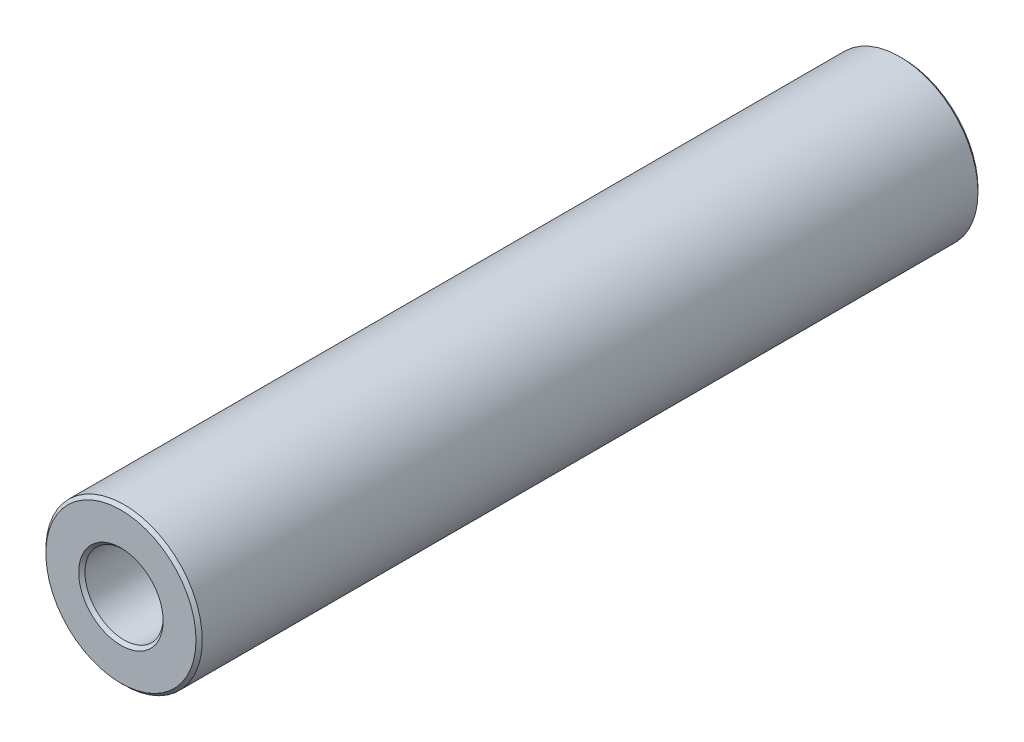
from build123d import *

# Parameters (mm, degrees)
SKETCH1_R           = 2.5
SKETCH1_R_2         = 1.25
BOSS_EXTRUDE2_DEPTH = 12.5
CHAMFER3_SIZE       = 0.1


with BuildPart() as part:
    # Sketch1 → Boss-Extrude2 (new, symmetric)
    with BuildSketch(Plane.XY):
        Circle(SKETCH1_R)
        Circle(SKETCH1_R_2, mode=Mode.SUBTRACT)
    extrude(amount=BOSS_EXTRUDE2_DEPTH, both=True)

    # Chamfer3
    chamfer3_edges = [part.edges().sort_by_distance(p)[0] for p in [
        (-2.5, 0, -12.5),
        (-2.5, 0, 12.5),
        (-1.25, 0, -12.5),
        (-1.25, 0, 12.5),
    ]]
    chamfer(chamfer3_edges, length=CHAMFER3_SIZE)


solid = part.part
